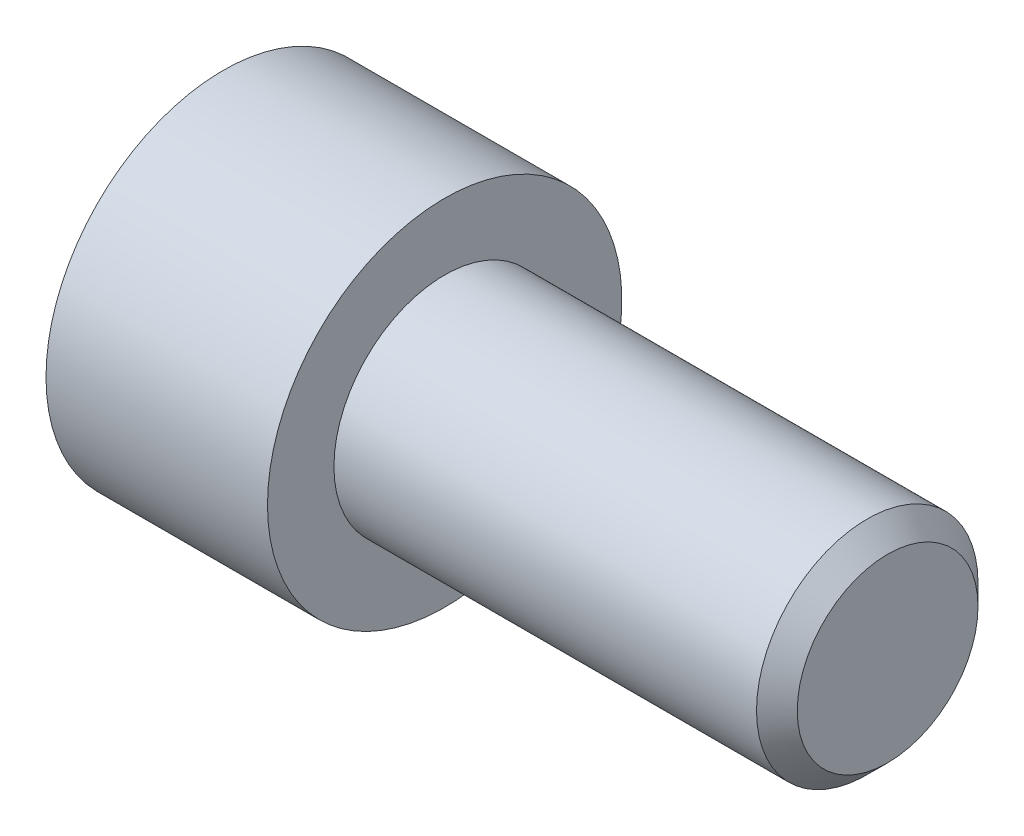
from build123d import *

# Parameters (mm, degrees)
ENL_V_MAT_EXTRU_1_DEPTH = 5


with BuildPart() as part:
    # Esquisse1 → R_volution1 (revolve)
    with BuildSketch(Plane.XY, mode=Mode.PRIVATE) as r_volution1_sk:
        Polygon((-10, 0), (-10, 8), (0, 8), (0, 5), (19.08, 5), (20, 4.08), (20, 0), align=None)
    revolve(r_volution1_sk.sketch.rotate(Axis((20, 0, 0), (-1, 0, 0)), 270), axis=Axis((20, 0, 0), (-1, 0, 0)))

    # Esquisse2 → Enl_v. mat.-Extru.1 (cut)
    with BuildSketch(Plane(origin=(-10, 0, 0), x_dir=(0, 0, -1), z_dir=(1, 0, 0))):
        Polygon((-4, 2.309401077), (-4, -2.309401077), (0, -4.618802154), (4, -2.309401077), (4, 2.309401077), (0, 4.618802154), align=None)
    extrude(amount=ENL_V_MAT_EXTRU_1_DEPTH, mode=Mode.SUBTRACT)

    # Esquisse3 → Enl_vement de mati_re-R_volution1 (revolve, cut)
    with BuildSketch(Plane.XY, mode=Mode.PRIVATE) as enl_vement_de_mati_re_r_volution1_sk:
        Polygon((-5, 0), (-5, 3.99), (-2.696372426, 0), align=None)
    revolve(enl_vement_de_mati_re_r_volution1_sk.sketch.rotate(Axis((-2.696372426, 0, 0), (-1, 0, 0)), 180), axis=Axis((-2.696372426, 0, 0), (-1, 0, 0)), mode=Mode.SUBTRACT)


solid = part.part
